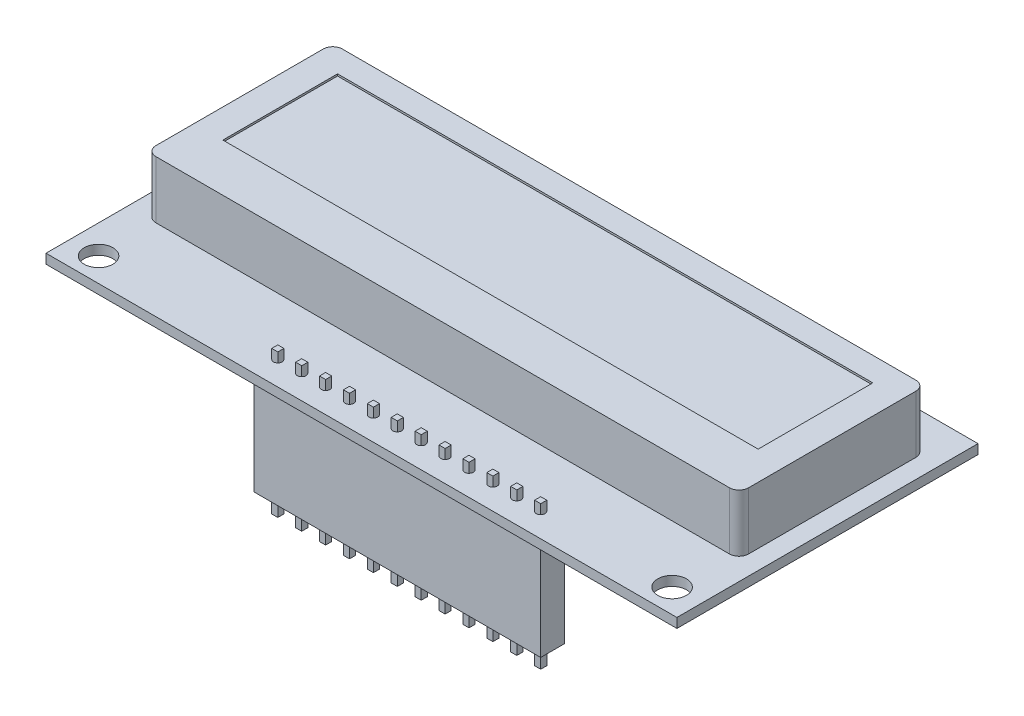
from build123d import *

# Parameters (mm, degrees)
EXTRUDE_START           = 11
SKETCH_1_W              = 66
SKETCH_1_H              = 31.5
EXTRUDE_1_DEPTH         = 1
SKETCH_2_W              = 62
SKETCH_2_H              = 19.5
EXTRUDE_2_DEPTH         = 6
FILLET_1_R              = 1
SKETCH_3_W              = 56
SKETCH_3_H              = 12
CUT_EXTRUDE_3_DEPTH     = 0.2
SKETCH_4_W              = 5
SKETCH_4_H              = 0.8
EXTRUDE_4_DEPTH         = 2.5
HOLE_WIZARD_3_0_3_1_D   = 3
HOLE_WIZARD_0_9_0_9_1_D = 0.9
SKETCH_10_W             = 30
SKETCH_10_H             = 2.5
EXTRUDE_5_DEPTH         = 11
EXTRUDE_6_DEPTH         = 1
EXTRUDE_6_DEPTH_BACK    = 14
SKETCH_11_W             = 0.64
SKETCH_11_H             = 0.64


with BuildPart() as part:
    # Sketch 1 → Extrude 1 (new body)
    with BuildSketch(Plane(origin=(0, 0, 0), x_dir=(1, 0, 0), z_dir=(0, 1, 0)).offset(EXTRUDE_START)):
        with Locations((0, -3.75)):
            Rectangle(SKETCH_1_W, SKETCH_1_H)
    extrude(amount=EXTRUDE_1_DEPTH)

    # Sketch 2 → Extrude 2 (add)
    with BuildSketch(Plane(origin=(0, 12, 0), x_dir=(1, 0, 0), z_dir=(0, 1, 0))):
        with Locations((0, -1.25)):
            Rectangle(SKETCH_2_W, SKETCH_2_H)
    extrude(amount=EXTRUDE_2_DEPTH)

    # Fillet 1
    fillet_1_edges = [part.edges().sort_by_distance(p)[0] for p in [
        (-31, 15, -8.5),
        (-31, 15, 11),
        (31, 15, 11),
        (31, 15, -8.5),
    ]]
    fillet(fillet_1_edges, radius=FILLET_1_R)

    # Sketch 3 → Cut-Extrude 3 (cut)
    with BuildSketch(Plane(origin=(0, 18, 0), x_dir=(1, 0, 0), z_dir=(0, 1, 0))):
        Rectangle(SKETCH_3_W, SKETCH_3_H)
    extrude(amount=-CUT_EXTRUDE_3_DEPTH, mode=Mode.SUBTRACT)

    # Sketch 4 → Extrude 4 (add)
    with BuildSketch(Plane.XZ.offset(-11)):
        with Locations((0, -8.1)):
            Rectangle(SKETCH_4_W, SKETCH_4_H)
        with Locations((-24, -8.1)):
            Rectangle(SKETCH_4_W, SKETCH_4_H)
        with Locations((24, -8.1)):
            Rectangle(SKETCH_4_W, SKETCH_4_H)
        with Locations((-24, 10.6)):
            Rectangle(SKETCH_4_W, SKETCH_4_H)
        with Locations((0, 10.6)):
            Rectangle(SKETCH_4_W, SKETCH_4_H)
        with Locations((24, 10.6)):
            Rectangle(SKETCH_4_W, SKETCH_4_H)
    extrude(amount=EXTRUDE_4_DEPTH)

    # Hole Wizard 3.0 _3_1 (through all)
    with Locations(Plane(origin=(0, 12, 0), x_dir=(-1, 0, 0), z_dir=(0, 1, 0))):
        with Locations((30, 17), (-30, 17)):
            Hole(HOLE_WIZARD_3_0_3_1_D / 2)

    # Hole Wizard 0.9 _0.9_1 (through all)
    with Locations(Plane(origin=(0, 12, 0), x_dir=(-1, 0, 0), z_dir=(0, 1, 0))):
        with Locations((11.25, 17), (8.75, 17), (6.25, 17), (3.75, 17), (1.25, 17), (-1.25, 17), (-3.75, 17), (-6.25, 17), (-8.75, 17), (-11.25, 17), (-13.75, 17), (-16.25, 17)):
            Hole(HOLE_WIZARD_0_9_0_9_1_D / 2)

    # Sketch 10 → Extrude 5 (add)
    with BuildSketch(Plane.XZ.offset(-11)):
        with Locations((2.5, 17)):
            Rectangle(SKETCH_10_W, SKETCH_10_H)
    extrude(amount=EXTRUDE_5_DEPTH)

    # Sketch 11 → Extrude 6 (add, two sides: drawn at the far end of the back side and taken through both)
    with BuildSketch(Plane(origin=(0, 12, 0), x_dir=(1, 0, 0), z_dir=(0, 1, 0)).offset(-EXTRUDE_6_DEPTH_BACK)):
        with Locations((-8.75, -17)):
            Rectangle(SKETCH_11_W, SKETCH_11_H)
        with Locations((-11.25, -17)):
            Rectangle(SKETCH_11_W, SKETCH_11_H)
        with Locations((-6.25, -17)):
            Rectangle(SKETCH_11_W, SKETCH_11_H)
        with Locations((-3.75, -17)):
            Rectangle(SKETCH_11_W, SKETCH_11_H)
        with Locations((-1.25, -17)):
            Rectangle(SKETCH_11_W, SKETCH_11_H)
        with Locations((1.25, -17)):
            Rectangle(SKETCH_11_W, SKETCH_11_H)
        with Locations((3.75, -17)):
            Rectangle(SKETCH_11_W, SKETCH_11_H)
        with Locations((6.25, -17)):
            Rectangle(SKETCH_11_W, SKETCH_11_H)
        with Locations((8.75, -17)):
            Rectangle(SKETCH_11_W, SKETCH_11_H)
        with Locations((11.25, -17)):
            Rectangle(SKETCH_11_W, SKETCH_11_H)
        with Locations((13.75, -17)):
            Rectangle(SKETCH_11_W, SKETCH_11_H)
        with Locations((16.25, -17)):
            Rectangle(SKETCH_11_W, SKETCH_11_H)
    extrude(amount=EXTRUDE_6_DEPTH + EXTRUDE_6_DEPTH_BACK)


solid = part.part
